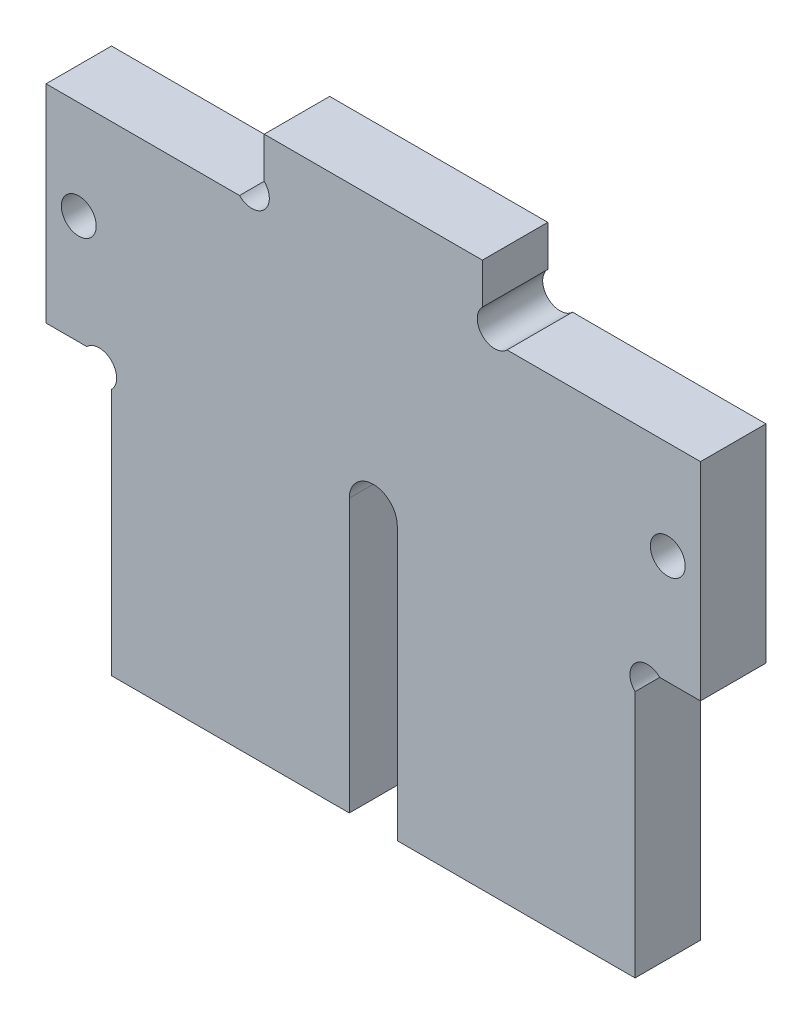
ISO-10303-21;
HEADER;
FILE_DESCRIPTION(('STEP AP214'),'2;1');
FILE_NAME('part.step','',(''),(''),'','','');
FILE_SCHEMA(('AUTOMOTIVE_DESIGN { 1 0 10303 214 1 1 1 1 }'));
ENDSEC;
DATA;
#1=APPLICATION_CONTEXT('core data for automotive mechanical design processes');
#2=APPLICATION_PROTOCOL_DEFINITION('international standard','automotive_design',2000,#1);
#3=PRODUCT_CONTEXT('',#1,'mechanical');
#4=PRODUCT('Part','Part','',(#3));
#5=PRODUCT_RELATED_PRODUCT_CATEGORY('part','',(#4));
#6=PRODUCT_DEFINITION_FORMATION('','',#4);
#7=PRODUCT_DEFINITION_CONTEXT('part definition',#1,'design');
#8=PRODUCT_DEFINITION('design','',#6,#7);
#9=PRODUCT_DEFINITION_SHAPE('','',#8);
#10=(LENGTH_UNIT() NAMED_UNIT(*) SI_UNIT(.MILLI.,.METRE.));
#11=(NAMED_UNIT(*) PLANE_ANGLE_UNIT() SI_UNIT($,.RADIAN.));
#12=(NAMED_UNIT(*) SI_UNIT($,.STERADIAN.) SOLID_ANGLE_UNIT());
#13=UNCERTAINTY_MEASURE_WITH_UNIT(LENGTH_MEASURE(1.E-05),#10,'distance_accuracy_value','');
#14=(GEOMETRIC_REPRESENTATION_CONTEXT(3) GLOBAL_UNCERTAINTY_ASSIGNED_CONTEXT((#13)) GLOBAL_UNIT_ASSIGNED_CONTEXT((#10,
#11,#12)) REPRESENTATION_CONTEXT('',''));
#15=CARTESIAN_POINT('',(0.,0.,0.));
#16=DIRECTION('',(0.,0.,1.));
#17=DIRECTION('',(1.,0.,0.));
#18=AXIS2_PLACEMENT_3D('',#15,#16,#17);
#19=CARTESIAN_POINT('',(11.1313708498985,45.1313708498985,6.));
#20=DIRECTION('',(0.,0.,1.));
#21=DIRECTION('',(1.,0.,0.));
#22=AXIS2_PLACEMENT_3D('',#19,#20,#21);
#23=PLANE('',#22);
#24=CARTESIAN_POINT('',(27.,35.,6.));
#25=DIRECTION('',(0.,0.,1.));
#26=DIRECTION('',(1.,0.,0.));
#27=AXIS2_PLACEMENT_3D('',#24,#25,#26);
#28=CIRCLE('',#27,1.6);
#29=CARTESIAN_POINT('',(28.6,35.,6.));
#30=VERTEX_POINT('',#29);
#31=EDGE_CURVE('E210',#30,#30,#28,.T.);
#32=ORIENTED_EDGE('',*,*,#31,.F.);
#33=EDGE_LOOP('',(#32));
#34=FACE_BOUND('',#33,.T.);
#35=CARTESIAN_POINT('',(11.1313708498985,45.1313708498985,6.));
#36=DIRECTION('',(0.,0.,-1.));
#37=DIRECTION('',(1.,0.,0.));
#38=AXIS2_PLACEMENT_3D('',#35,#36,#37);
#39=CIRCLE('',#38,1.60000000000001);
#40=CARTESIAN_POINT('',(12.262741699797,44.,6.));
#41=VERTEX_POINT('',#40);
#42=CARTESIAN_POINT('',(10.,46.262741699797,6.));
#43=VERTEX_POINT('',#42);
#44=EDGE_CURVE('E245',#41,#43,#39,.T.);
#45=ORIENTED_EDGE('',*,*,#44,.T.);
#46=DIRECTION('',(0.,1.,0.));
#47=VECTOR('',#46,1.);
#48=CARTESIAN_POINT('',(10.,46.262741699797,6.));
#49=LINE('',#48,#47);
#50=CARTESIAN_POINT('',(10.,50.,6.));
#51=VERTEX_POINT('',#50);
#52=EDGE_CURVE('E133',#43,#51,#49,.T.);
#53=ORIENTED_EDGE('',*,*,#52,.T.);
#54=DIRECTION('',(-1.,0.,0.));
#55=VECTOR('',#54,1.);
#56=CARTESIAN_POINT('',(-10.,50.,6.));
#57=LINE('',#56,#55);
#58=CARTESIAN_POINT('',(-10.,50.,6.));
#59=VERTEX_POINT('',#58);
#60=EDGE_CURVE('E296',#51,#59,#57,.T.);
#61=ORIENTED_EDGE('',*,*,#60,.T.);
#62=DIRECTION('',(0.,-1.,0.));
#63=VECTOR('',#62,1.);
#64=CARTESIAN_POINT('',(-10.,46.262741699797,6.));
#65=LINE('',#64,#63);
#66=CARTESIAN_POINT('',(-10.,46.262741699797,6.));
#67=VERTEX_POINT('',#66);
#68=EDGE_CURVE('E315',#59,#67,#65,.T.);
#69=ORIENTED_EDGE('',*,*,#68,.T.);
#70=CARTESIAN_POINT('',(-11.1313708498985,45.1313708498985,6.));
#71=DIRECTION('',(0.,0.,-1.));
#72=DIRECTION('',(-1.,0.,0.));
#73=AXIS2_PLACEMENT_3D('',#70,#71,#72);
#74=CIRCLE('',#73,1.60000000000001);
#75=CARTESIAN_POINT('',(-12.262741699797,44.,6.));
#76=VERTEX_POINT('',#75);
#77=EDGE_CURVE('E312',#67,#76,#74,.T.);
#78=ORIENTED_EDGE('',*,*,#77,.T.);
#79=DIRECTION('',(-1.,0.,0.));
#80=VECTOR('',#79,1.);
#81=CARTESIAN_POINT('',(-12.262741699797,44.,6.));
#82=LINE('',#81,#80);
#83=CARTESIAN_POINT('',(-30.,44.,6.));
#84=VERTEX_POINT('',#83);
#85=EDGE_CURVE('E314',#76,#84,#82,.T.);
#86=ORIENTED_EDGE('',*,*,#85,.T.);
#87=DIRECTION('',(0.,-1.,0.));
#88=VECTOR('',#87,1.);
#89=CARTESIAN_POINT('',(-30.,44.,6.));
#90=LINE('',#89,#88);
#91=CARTESIAN_POINT('',(-30.,25.,6.));
#92=VERTEX_POINT('',#91);
#93=EDGE_CURVE('E317',#84,#92,#90,.T.);
#94=ORIENTED_EDGE('',*,*,#93,.T.);
#95=DIRECTION('',(1.,0.,0.));
#96=VECTOR('',#95,1.);
#97=CARTESIAN_POINT('',(-30.,25.,6.));
#98=LINE('',#97,#96);
#99=CARTESIAN_POINT('',(-26.262741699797,25.,6.));
#100=VERTEX_POINT('',#99);
#101=EDGE_CURVE('E323',#92,#100,#98,.T.);
#102=ORIENTED_EDGE('',*,*,#101,.T.);
#103=CARTESIAN_POINT('',(-25.1313708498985,23.8686291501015,6.));
#104=DIRECTION('',(0.,0.,-1.));
#105=DIRECTION('',(-1.,0.,0.));
#106=AXIS2_PLACEMENT_3D('',#103,#104,#105);
#107=CIRCLE('',#106,1.60000000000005);
#108=CARTESIAN_POINT('',(-24.,22.737258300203,6.));
#109=VERTEX_POINT('',#108);
#110=EDGE_CURVE('E325',#100,#109,#107,.T.);
#111=ORIENTED_EDGE('',*,*,#110,.T.);
#112=DIRECTION('',(0.,-1.,0.));
#113=VECTOR('',#112,1.);
#114=CARTESIAN_POINT('',(-24.,22.737258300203,6.));
#115=LINE('',#114,#113);
#116=CARTESIAN_POINT('',(-24.,0.,6.));
#117=VERTEX_POINT('',#116);
#118=EDGE_CURVE('E327',#109,#117,#115,.T.);
#119=ORIENTED_EDGE('',*,*,#118,.T.);
#120=DIRECTION('',(1.,0.,0.));
#121=VECTOR('',#120,1.);
#122=CARTESIAN_POINT('',(-24.,0.,6.));
#123=LINE('',#122,#121);
#124=CARTESIAN_POINT('',(-2.2,0.,6.));
#125=VERTEX_POINT('',#124);
#126=EDGE_CURVE('E329',#117,#125,#123,.T.);
#127=ORIENTED_EDGE('',*,*,#126,.T.);
#128=DIRECTION('',(0.,1.,0.));
#129=VECTOR('',#128,1.);
#130=CARTESIAN_POINT('',(-2.2,25.,6.));
#131=LINE('',#130,#129);
#132=CARTESIAN_POINT('',(-2.2,25.,6.));
#133=VERTEX_POINT('',#132);
#134=EDGE_CURVE('E331',#125,#133,#131,.T.);
#135=ORIENTED_EDGE('',*,*,#134,.T.);
#136=CARTESIAN_POINT('',(0.,25.,6.));
#137=DIRECTION('',(0.,0.,-1.));
#138=DIRECTION('',(1.,0.,0.));
#139=AXIS2_PLACEMENT_3D('',#136,#137,#138);
#140=CIRCLE('',#139,2.2);
#141=CARTESIAN_POINT('',(2.2,25.,6.));
#142=VERTEX_POINT('',#141);
#143=EDGE_CURVE('E333',#133,#142,#140,.T.);
#144=ORIENTED_EDGE('',*,*,#143,.T.);
#145=DIRECTION('',(0.,-1.,0.));
#146=VECTOR('',#145,1.);
#147=CARTESIAN_POINT('',(2.2,25.,6.));
#148=LINE('',#147,#146);
#149=CARTESIAN_POINT('',(2.2,0.,6.));
#150=VERTEX_POINT('',#149);
#151=EDGE_CURVE('E335',#142,#150,#148,.T.);
#152=ORIENTED_EDGE('',*,*,#151,.T.);
#153=DIRECTION('',(1.,0.,0.));
#154=VECTOR('',#153,1.);
#155=CARTESIAN_POINT('',(2.2,0.,6.));
#156=LINE('',#155,#154);
#157=CARTESIAN_POINT('',(24.,0.,6.));
#158=VERTEX_POINT('',#157);
#159=EDGE_CURVE('E337',#150,#158,#156,.T.);
#160=ORIENTED_EDGE('',*,*,#159,.T.);
#161=DIRECTION('',(0.,1.,0.));
#162=VECTOR('',#161,1.);
#163=CARTESIAN_POINT('',(24.,22.7372583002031,6.));
#164=LINE('',#163,#162);
#165=CARTESIAN_POINT('',(24.,22.7372583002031,6.));
#166=VERTEX_POINT('',#165);
#167=EDGE_CURVE('E339',#158,#166,#164,.T.);
#168=ORIENTED_EDGE('',*,*,#167,.T.);
#169=CARTESIAN_POINT('',(25.1313708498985,23.8686291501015,6.));
#170=DIRECTION('',(0.,0.,-1.));
#171=DIRECTION('',(1.,0.,0.));
#172=AXIS2_PLACEMENT_3D('',#169,#170,#171);
#173=CIRCLE('',#172,1.60000000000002);
#174=CARTESIAN_POINT('',(26.262741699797,25.,6.));
#175=VERTEX_POINT('',#174);
#176=EDGE_CURVE('E188',#166,#175,#173,.T.);
#177=ORIENTED_EDGE('',*,*,#176,.T.);
#178=DIRECTION('',(1.,0.,0.));
#179=VECTOR('',#178,1.);
#180=CARTESIAN_POINT('',(30.,25.,6.));
#181=LINE('',#180,#179);
#182=CARTESIAN_POINT('',(30.,25.,6.));
#183=VERTEX_POINT('',#182);
#184=EDGE_CURVE('E182',#175,#183,#181,.T.);
#185=ORIENTED_EDGE('',*,*,#184,.T.);
#186=DIRECTION('',(0.,1.,0.));
#187=VECTOR('',#186,1.);
#188=CARTESIAN_POINT('',(30.,44.,6.));
#189=LINE('',#188,#187);
#190=CARTESIAN_POINT('',(30.,44.,6.));
#191=VERTEX_POINT('',#190);
#192=EDGE_CURVE('E186',#183,#191,#189,.T.);
#193=ORIENTED_EDGE('',*,*,#192,.T.);
#194=DIRECTION('',(-1.,0.,0.));
#195=VECTOR('',#194,1.);
#196=CARTESIAN_POINT('',(12.262741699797,44.,6.));
#197=LINE('',#196,#195);
#198=EDGE_CURVE('E54',#191,#41,#197,.T.);
#199=ORIENTED_EDGE('',*,*,#198,.T.);
#200=EDGE_LOOP('',(#45,#53,#61,#69,#78,#86,#94,#102,#111,#119,#127,#135,#144,#152,#160,#168,
#177,#185,#193,#199));
#201=FACE_BOUND('',#200,.T.);
#202=CARTESIAN_POINT('',(-27.,35.,6.));
#203=DIRECTION('',(0.,0.,1.));
#204=DIRECTION('',(-1.,0.,0.));
#205=AXIS2_PLACEMENT_3D('',#202,#203,#204);
#206=CIRCLE('',#205,1.6);
#207=CARTESIAN_POINT('',(-28.6,35.,6.));
#208=VERTEX_POINT('',#207);
#209=EDGE_CURVE('E382',#208,#208,#206,.T.);
#210=ORIENTED_EDGE('',*,*,#209,.F.);
#211=EDGE_LOOP('',(#210));
#212=FACE_BOUND('',#211,.T.);
#213=ADVANCED_FACE('F37',(#34,#201,#212),#23,.T.);
#214=CARTESIAN_POINT('',(11.1313708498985,45.1313708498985,0.));
#215=DIRECTION('',(0.,0.,1.));
#216=DIRECTION('',(1.,0.,0.));
#217=AXIS2_PLACEMENT_3D('',#214,#215,#216);
#218=PLANE('',#217);
#219=CARTESIAN_POINT('',(27.,35.,0.));
#220=DIRECTION('',(0.,0.,1.));
#221=DIRECTION('',(1.,0.,0.));
#222=AXIS2_PLACEMENT_3D('',#219,#220,#221);
#223=CIRCLE('',#222,1.6);
#224=CARTESIAN_POINT('',(28.6,35.,0.));
#225=VERTEX_POINT('',#224);
#226=EDGE_CURVE('E387',#225,#225,#223,.T.);
#227=ORIENTED_EDGE('',*,*,#226,.T.);
#228=EDGE_LOOP('',(#227));
#229=FACE_BOUND('',#228,.T.);
#230=CARTESIAN_POINT('',(11.1313708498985,45.1313708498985,0.));
#231=DIRECTION('',(0.,0.,-1.));
#232=DIRECTION('',(1.,0.,0.));
#233=AXIS2_PLACEMENT_3D('',#230,#231,#232);
#234=CIRCLE('',#233,1.60000000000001);
#235=CARTESIAN_POINT('',(12.262741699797,44.,0.));
#236=VERTEX_POINT('',#235);
#237=CARTESIAN_POINT('',(10.,46.262741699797,0.));
#238=VERTEX_POINT('',#237);
#239=EDGE_CURVE('E206',#236,#238,#234,.T.);
#240=ORIENTED_EDGE('',*,*,#239,.F.);
#241=DIRECTION('',(-1.,0.,0.));
#242=VECTOR('',#241,1.);
#243=CARTESIAN_POINT('',(12.262741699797,44.,0.));
#244=LINE('',#243,#242);
#245=CARTESIAN_POINT('',(30.,44.,0.));
#246=VERTEX_POINT('',#245);
#247=EDGE_CURVE('E125',#246,#236,#244,.T.);
#248=ORIENTED_EDGE('',*,*,#247,.F.);
#249=DIRECTION('',(0.,1.,0.));
#250=VECTOR('',#249,1.);
#251=CARTESIAN_POINT('',(30.,44.,0.));
#252=LINE('',#251,#250);
#253=CARTESIAN_POINT('',(30.,25.,0.));
#254=VERTEX_POINT('',#253);
#255=EDGE_CURVE('E119',#254,#246,#252,.T.);
#256=ORIENTED_EDGE('',*,*,#255,.F.);
#257=DIRECTION('',(1.,0.,0.));
#258=VECTOR('',#257,1.);
#259=CARTESIAN_POINT('',(30.,25.,0.));
#260=LINE('',#259,#258);
#261=CARTESIAN_POINT('',(26.262741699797,25.,0.));
#262=VERTEX_POINT('',#261);
#263=EDGE_CURVE('E196',#262,#254,#260,.T.);
#264=ORIENTED_EDGE('',*,*,#263,.F.);
#265=CARTESIAN_POINT('',(25.1313708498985,23.8686291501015,0.));
#266=DIRECTION('',(0.,0.,-1.));
#267=DIRECTION('',(1.,0.,0.));
#268=AXIS2_PLACEMENT_3D('',#265,#266,#267);
#269=CIRCLE('',#268,1.60000000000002);
#270=CARTESIAN_POINT('',(24.,22.7372583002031,0.));
#271=VERTEX_POINT('',#270);
#272=EDGE_CURVE('E240',#271,#262,#269,.T.);
#273=ORIENTED_EDGE('',*,*,#272,.F.);
#274=DIRECTION('',(0.,1.,0.));
#275=VECTOR('',#274,1.);
#276=CARTESIAN_POINT('',(24.,22.7372583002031,0.));
#277=LINE('',#276,#275);
#278=CARTESIAN_POINT('',(24.,0.,0.));
#279=VERTEX_POINT('',#278);
#280=EDGE_CURVE('E238',#279,#271,#277,.T.);
#281=ORIENTED_EDGE('',*,*,#280,.F.);
#282=DIRECTION('',(1.,0.,0.));
#283=VECTOR('',#282,1.);
#284=CARTESIAN_POINT('',(2.2,0.,0.));
#285=LINE('',#284,#283);
#286=CARTESIAN_POINT('',(2.2,0.,0.));
#287=VERTEX_POINT('',#286);
#288=EDGE_CURVE('E236',#287,#279,#285,.T.);
#289=ORIENTED_EDGE('',*,*,#288,.F.);
#290=DIRECTION('',(0.,-1.,0.));
#291=VECTOR('',#290,1.);
#292=CARTESIAN_POINT('',(2.2,25.,0.));
#293=LINE('',#292,#291);
#294=CARTESIAN_POINT('',(2.2,25.,0.));
#295=VERTEX_POINT('',#294);
#296=EDGE_CURVE('E234',#295,#287,#293,.T.);
#297=ORIENTED_EDGE('',*,*,#296,.F.);
#298=CARTESIAN_POINT('',(0.,25.,0.));
#299=DIRECTION('',(0.,0.,-1.));
#300=DIRECTION('',(1.,0.,0.));
#301=AXIS2_PLACEMENT_3D('',#298,#299,#300);
#302=CIRCLE('',#301,2.2);
#303=CARTESIAN_POINT('',(-2.2,25.,0.));
#304=VERTEX_POINT('',#303);
#305=EDGE_CURVE('E232',#304,#295,#302,.T.);
#306=ORIENTED_EDGE('',*,*,#305,.F.);
#307=DIRECTION('',(0.,1.,0.));
#308=VECTOR('',#307,1.);
#309=CARTESIAN_POINT('',(-2.2,25.,0.));
#310=LINE('',#309,#308);
#311=CARTESIAN_POINT('',(-2.2,0.,0.));
#312=VERTEX_POINT('',#311);
#313=EDGE_CURVE('E230',#312,#304,#310,.T.);
#314=ORIENTED_EDGE('',*,*,#313,.F.);
#315=DIRECTION('',(1.,0.,0.));
#316=VECTOR('',#315,1.);
#317=CARTESIAN_POINT('',(-24.,0.,0.));
#318=LINE('',#317,#316);
#319=CARTESIAN_POINT('',(-24.,0.,0.));
#320=VERTEX_POINT('',#319);
#321=EDGE_CURVE('E228',#320,#312,#318,.T.);
#322=ORIENTED_EDGE('',*,*,#321,.F.);
#323=DIRECTION('',(0.,-1.,0.));
#324=VECTOR('',#323,1.);
#325=CARTESIAN_POINT('',(-24.,22.737258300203,0.));
#326=LINE('',#325,#324);
#327=CARTESIAN_POINT('',(-24.,22.737258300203,0.));
#328=VERTEX_POINT('',#327);
#329=EDGE_CURVE('E226',#328,#320,#326,.T.);
#330=ORIENTED_EDGE('',*,*,#329,.F.);
#331=CARTESIAN_POINT('',(-25.1313708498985,23.8686291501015,0.));
#332=DIRECTION('',(0.,0.,-1.));
#333=DIRECTION('',(-1.,0.,0.));
#334=AXIS2_PLACEMENT_3D('',#331,#332,#333);
#335=CIRCLE('',#334,1.60000000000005);
#336=CARTESIAN_POINT('',(-26.262741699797,25.,0.));
#337=VERTEX_POINT('',#336);
#338=EDGE_CURVE('E224',#337,#328,#335,.T.);
#339=ORIENTED_EDGE('',*,*,#338,.F.);
#340=DIRECTION('',(1.,0.,0.));
#341=VECTOR('',#340,1.);
#342=CARTESIAN_POINT('',(-30.,25.,0.));
#343=LINE('',#342,#341);
#344=CARTESIAN_POINT('',(-30.,25.,0.));
#345=VERTEX_POINT('',#344);
#346=EDGE_CURVE('E222',#345,#337,#343,.T.);
#347=ORIENTED_EDGE('',*,*,#346,.F.);
#348=DIRECTION('',(0.,-1.,0.));
#349=VECTOR('',#348,1.);
#350=CARTESIAN_POINT('',(-30.,44.,0.));
#351=LINE('',#350,#349);
#352=CARTESIAN_POINT('',(-30.,44.,0.));
#353=VERTEX_POINT('',#352);
#354=EDGE_CURVE('E220',#353,#345,#351,.T.);
#355=ORIENTED_EDGE('',*,*,#354,.F.);
#356=DIRECTION('',(-1.,0.,0.));
#357=VECTOR('',#356,1.);
#358=CARTESIAN_POINT('',(-12.262741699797,44.,0.));
#359=LINE('',#358,#357);
#360=CARTESIAN_POINT('',(-12.262741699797,44.,0.));
#361=VERTEX_POINT('',#360);
#362=EDGE_CURVE('E218',#361,#353,#359,.T.);
#363=ORIENTED_EDGE('',*,*,#362,.F.);
#364=CARTESIAN_POINT('',(-11.1313708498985,45.1313708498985,0.));
#365=DIRECTION('',(0.,0.,-1.));
#366=DIRECTION('',(-1.,0.,0.));
#367=AXIS2_PLACEMENT_3D('',#364,#365,#366);
#368=CIRCLE('',#367,1.60000000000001);
#369=CARTESIAN_POINT('',(-10.,46.262741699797,0.));
#370=VERTEX_POINT('',#369);
#371=EDGE_CURVE('E216',#370,#361,#368,.T.);
#372=ORIENTED_EDGE('',*,*,#371,.F.);
#373=DIRECTION('',(0.,-1.,0.));
#374=VECTOR('',#373,1.);
#375=CARTESIAN_POINT('',(-10.,46.262741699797,0.));
#376=LINE('',#375,#374);
#377=CARTESIAN_POINT('',(-10.,50.,0.));
#378=VERTEX_POINT('',#377);
#379=EDGE_CURVE('E214',#378,#370,#376,.T.);
#380=ORIENTED_EDGE('',*,*,#379,.F.);
#381=DIRECTION('',(-1.,0.,0.));
#382=VECTOR('',#381,1.);
#383=CARTESIAN_POINT('',(-10.,50.,0.));
#384=LINE('',#383,#382);
#385=CARTESIAN_POINT('',(10.,50.,0.));
#386=VERTEX_POINT('',#385);
#387=EDGE_CURVE('E212',#386,#378,#384,.T.);
#388=ORIENTED_EDGE('',*,*,#387,.F.);
#389=DIRECTION('',(0.,1.,0.));
#390=VECTOR('',#389,1.);
#391=CARTESIAN_POINT('',(10.,46.262741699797,0.));
#392=LINE('',#391,#390);
#393=EDGE_CURVE('E209',#238,#386,#392,.T.);
#394=ORIENTED_EDGE('',*,*,#393,.F.);
#395=EDGE_LOOP('',(#240,#248,#256,#264,#273,#281,#289,#297,#306,#314,#322,#330,#339,#347,#355,
#363,#372,#380,#388,#394));
#396=FACE_BOUND('',#395,.T.);
#397=CARTESIAN_POINT('',(-27.,35.,0.));
#398=DIRECTION('',(0.,0.,1.));
#399=DIRECTION('',(-1.,0.,0.));
#400=AXIS2_PLACEMENT_3D('',#397,#398,#399);
#401=CIRCLE('',#400,1.6);
#402=CARTESIAN_POINT('',(-28.6,35.,0.));
#403=VERTEX_POINT('',#402);
#404=EDGE_CURVE('E385',#403,#403,#401,.T.);
#405=ORIENTED_EDGE('',*,*,#404,.T.);
#406=EDGE_LOOP('',(#405));
#407=FACE_BOUND('',#406,.T.);
#408=ADVANCED_FACE('F300',(#229,#396,#407),#218,.F.);
#409=CARTESIAN_POINT('',(11.1313708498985,45.1313708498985,6.));
#410=DIRECTION('',(0.,0.,-1.));
#411=DIRECTION('',(-1.,0.,0.));
#412=AXIS2_PLACEMENT_3D('',#409,#410,#411);
#413=CYLINDRICAL_SURFACE('',#412,1.60000000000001);
#414=ORIENTED_EDGE('',*,*,#239,.T.);
#415=DIRECTION('',(0.,0.,-1.));
#416=VECTOR('',#415,1.);
#417=CARTESIAN_POINT('',(10.,46.262741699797,6.));
#418=LINE('',#417,#416);
#419=EDGE_CURVE('E11',#43,#238,#418,.T.);
#420=ORIENTED_EDGE('',*,*,#419,.F.);
#421=ORIENTED_EDGE('',*,*,#44,.F.);
#422=DIRECTION('',(0.,0.,-1.));
#423=VECTOR('',#422,1.);
#424=CARTESIAN_POINT('',(12.262741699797,44.,6.));
#425=LINE('',#424,#423);
#426=EDGE_CURVE('E202',#41,#236,#425,.T.);
#427=ORIENTED_EDGE('',*,*,#426,.T.);
#428=EDGE_LOOP('',(#414,#420,#421,#427));
#429=FACE_BOUND('',#428,.T.);
#430=ADVANCED_FACE('F39',(#429),#413,.F.);
#431=CARTESIAN_POINT('',(10.,46.262741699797,6.));
#432=DIRECTION('',(-1.,0.,0.));
#433=DIRECTION('',(0.,0.,1.));
#434=AXIS2_PLACEMENT_3D('',#431,#432,#433);
#435=PLANE('',#434);
#436=ORIENTED_EDGE('',*,*,#393,.T.);
#437=DIRECTION('',(0.,0.,-1.));
#438=VECTOR('',#437,1.);
#439=CARTESIAN_POINT('',(10.,50.,6.));
#440=LINE('',#439,#438);
#441=EDGE_CURVE('E46',#51,#386,#440,.T.);
#442=ORIENTED_EDGE('',*,*,#441,.F.);
#443=ORIENTED_EDGE('',*,*,#52,.F.);
#444=ORIENTED_EDGE('',*,*,#419,.T.);
#445=EDGE_LOOP('',(#436,#442,#443,#444));
#446=FACE_BOUND('',#445,.T.);
#447=ADVANCED_FACE('F560',(#446),#435,.F.);
#448=CARTESIAN_POINT('',(-10.,50.,6.));
#449=DIRECTION('',(0.,-1.,0.));
#450=DIRECTION('',(0.,0.,-1.));
#451=AXIS2_PLACEMENT_3D('',#448,#449,#450);
#452=PLANE('',#451);
#453=ORIENTED_EDGE('',*,*,#387,.T.);
#454=DIRECTION('',(0.,0.,-1.));
#455=VECTOR('',#454,1.);
#456=CARTESIAN_POINT('',(-10.,50.,6.));
#457=LINE('',#456,#455);
#458=EDGE_CURVE('E288',#59,#378,#457,.T.);
#459=ORIENTED_EDGE('',*,*,#458,.F.);
#460=ORIENTED_EDGE('',*,*,#60,.F.);
#461=ORIENTED_EDGE('',*,*,#441,.T.);
#462=EDGE_LOOP('',(#453,#459,#460,#461));
#463=FACE_BOUND('',#462,.T.);
#464=ADVANCED_FACE('F294',(#463),#452,.F.);
#465=CARTESIAN_POINT('',(-10.,46.262741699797,6.));
#466=DIRECTION('',(1.,0.,0.));
#467=DIRECTION('',(0.,1.,0.));
#468=AXIS2_PLACEMENT_3D('',#465,#466,#467);
#469=PLANE('',#468);
#470=ORIENTED_EDGE('',*,*,#379,.T.);
#471=DIRECTION('',(0.,0.,-1.));
#472=VECTOR('',#471,1.);
#473=CARTESIAN_POINT('',(-10.,46.262741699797,6.));
#474=LINE('',#473,#472);
#475=EDGE_CURVE('E285',#67,#370,#474,.T.);
#476=ORIENTED_EDGE('',*,*,#475,.F.);
#477=ORIENTED_EDGE('',*,*,#68,.F.);
#478=ORIENTED_EDGE('',*,*,#458,.T.);
#479=EDGE_LOOP('',(#470,#476,#477,#478));
#480=FACE_BOUND('',#479,.T.);
#481=ADVANCED_FACE('F306',(#480),#469,.F.);
#482=CARTESIAN_POINT('',(-11.1313708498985,45.1313708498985,6.));
#483=DIRECTION('',(0.,0.,-1.));
#484=DIRECTION('',(-1.,0.,0.));
#485=AXIS2_PLACEMENT_3D('',#482,#483,#484);
#486=CYLINDRICAL_SURFACE('',#485,1.60000000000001);
#487=ORIENTED_EDGE('',*,*,#371,.T.);
#488=DIRECTION('',(0.,0.,-1.));
#489=VECTOR('',#488,1.);
#490=CARTESIAN_POINT('',(-12.262741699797,44.,6.));
#491=LINE('',#490,#489);
#492=EDGE_CURVE('E282',#76,#361,#491,.T.);
#493=ORIENTED_EDGE('',*,*,#492,.F.);
#494=ORIENTED_EDGE('',*,*,#77,.F.);
#495=ORIENTED_EDGE('',*,*,#475,.T.);
#496=EDGE_LOOP('',(#487,#493,#494,#495));
#497=FACE_BOUND('',#496,.T.);
#498=ADVANCED_FACE('F310',(#497),#486,.F.);
#499=CARTESIAN_POINT('',(-12.262741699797,44.,6.));
#500=DIRECTION('',(0.,-1.,0.));
#501=DIRECTION('',(0.,0.,-1.));
#502=AXIS2_PLACEMENT_3D('',#499,#500,#501);
#503=PLANE('',#502);
#504=ORIENTED_EDGE('',*,*,#362,.T.);
#505=DIRECTION('',(0.,0.,-1.));
#506=VECTOR('',#505,1.);
#507=CARTESIAN_POINT('',(-30.,44.,6.));
#508=LINE('',#507,#506);
#509=EDGE_CURVE('E279',#84,#353,#508,.T.);
#510=ORIENTED_EDGE('',*,*,#509,.F.);
#511=ORIENTED_EDGE('',*,*,#85,.F.);
#512=ORIENTED_EDGE('',*,*,#492,.T.);
#513=EDGE_LOOP('',(#504,#510,#511,#512));
#514=FACE_BOUND('',#513,.T.);
#515=ADVANCED_FACE('F525',(#514),#503,.F.);
#516=CARTESIAN_POINT('',(-30.,44.,6.));
#517=DIRECTION('',(1.,0.,0.));
#518=DIRECTION('',(0.,0.,-1.));
#519=AXIS2_PLACEMENT_3D('',#516,#517,#518);
#520=PLANE('',#519);
#521=ORIENTED_EDGE('',*,*,#354,.T.);
#522=DIRECTION('',(0.,0.,-1.));
#523=VECTOR('',#522,1.);
#524=CARTESIAN_POINT('',(-30.,25.,6.));
#525=LINE('',#524,#523);
#526=EDGE_CURVE('E276',#92,#345,#525,.T.);
#527=ORIENTED_EDGE('',*,*,#526,.F.);
#528=ORIENTED_EDGE('',*,*,#93,.F.);
#529=ORIENTED_EDGE('',*,*,#509,.T.);
#530=EDGE_LOOP('',(#521,#527,#528,#529));
#531=FACE_BOUND('',#530,.T.);
#532=ADVANCED_FACE('F515',(#531),#520,.F.);
#533=CARTESIAN_POINT('',(-30.,25.,6.));
#534=DIRECTION('',(0.,1.,0.));
#535=DIRECTION('',(-1.,0.,0.));
#536=AXIS2_PLACEMENT_3D('',#533,#534,#535);
#537=PLANE('',#536);
#538=ORIENTED_EDGE('',*,*,#346,.T.);
#539=DIRECTION('',(0.,0.,-1.));
#540=VECTOR('',#539,1.);
#541=CARTESIAN_POINT('',(-26.262741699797,25.,6.));
#542=LINE('',#541,#540);
#543=EDGE_CURVE('E273',#100,#337,#542,.T.);
#544=ORIENTED_EDGE('',*,*,#543,.F.);
#545=ORIENTED_EDGE('',*,*,#101,.F.);
#546=ORIENTED_EDGE('',*,*,#526,.T.);
#547=EDGE_LOOP('',(#538,#544,#545,#546));
#548=FACE_BOUND('',#547,.T.);
#549=ADVANCED_FACE('F505',(#548),#537,.F.);
#550=CARTESIAN_POINT('',(-25.1313708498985,23.8686291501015,6.));
#551=DIRECTION('',(0.,0.,-1.));
#552=DIRECTION('',(-1.,0.,0.));
#553=AXIS2_PLACEMENT_3D('',#550,#551,#552);
#554=CYLINDRICAL_SURFACE('',#553,1.60000000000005);
#555=ORIENTED_EDGE('',*,*,#338,.T.);
#556=DIRECTION('',(0.,0.,-1.));
#557=VECTOR('',#556,1.);
#558=CARTESIAN_POINT('',(-24.,22.737258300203,6.));
#559=LINE('',#558,#557);
#560=EDGE_CURVE('E270',#109,#328,#559,.T.);
#561=ORIENTED_EDGE('',*,*,#560,.F.);
#562=ORIENTED_EDGE('',*,*,#110,.F.);
#563=ORIENTED_EDGE('',*,*,#543,.T.);
#564=EDGE_LOOP('',(#555,#561,#562,#563));
#565=FACE_BOUND('',#564,.T.);
#566=ADVANCED_FACE('F495',(#565),#554,.F.);
#567=CARTESIAN_POINT('',(-24.,22.737258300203,6.));
#568=DIRECTION('',(1.,0.,0.));
#569=DIRECTION('',(0.,1.,0.));
#570=AXIS2_PLACEMENT_3D('',#567,#568,#569);
#571=PLANE('',#570);
#572=ORIENTED_EDGE('',*,*,#329,.T.);
#573=DIRECTION('',(0.,0.,-1.));
#574=VECTOR('',#573,1.);
#575=CARTESIAN_POINT('',(-24.,0.,6.));
#576=LINE('',#575,#574);
#577=EDGE_CURVE('E267',#117,#320,#576,.T.);
#578=ORIENTED_EDGE('',*,*,#577,.F.);
#579=ORIENTED_EDGE('',*,*,#118,.F.);
#580=ORIENTED_EDGE('',*,*,#560,.T.);
#581=EDGE_LOOP('',(#572,#578,#579,#580));
#582=FACE_BOUND('',#581,.T.);
#583=ADVANCED_FACE('F485',(#582),#571,.F.);
#584=CARTESIAN_POINT('',(-24.,0.,6.));
#585=DIRECTION('',(0.,1.,0.));
#586=DIRECTION('',(0.,0.,1.));
#587=AXIS2_PLACEMENT_3D('',#584,#585,#586);
#588=PLANE('',#587);
#589=ORIENTED_EDGE('',*,*,#321,.T.);
#590=DIRECTION('',(0.,0.,-1.));
#591=VECTOR('',#590,1.);
#592=CARTESIAN_POINT('',(-2.2,0.,6.));
#593=LINE('',#592,#591);
#594=EDGE_CURVE('E264',#125,#312,#593,.T.);
#595=ORIENTED_EDGE('',*,*,#594,.F.);
#596=ORIENTED_EDGE('',*,*,#126,.F.);
#597=ORIENTED_EDGE('',*,*,#577,.T.);
#598=EDGE_LOOP('',(#589,#595,#596,#597));
#599=FACE_BOUND('',#598,.T.);
#600=ADVANCED_FACE('F475',(#599),#588,.F.);
#601=CARTESIAN_POINT('',(-2.2,25.,6.));
#602=DIRECTION('',(-1.,0.,0.));
#603=DIRECTION('',(0.,-1.,0.));
#604=AXIS2_PLACEMENT_3D('',#601,#602,#603);
#605=PLANE('',#604);
#606=ORIENTED_EDGE('',*,*,#313,.T.);
#607=DIRECTION('',(0.,0.,-1.));
#608=VECTOR('',#607,1.);
#609=CARTESIAN_POINT('',(-2.2,25.,6.));
#610=LINE('',#609,#608);
#611=EDGE_CURVE('E261',#133,#304,#610,.T.);
#612=ORIENTED_EDGE('',*,*,#611,.F.);
#613=ORIENTED_EDGE('',*,*,#134,.F.);
#614=ORIENTED_EDGE('',*,*,#594,.T.);
#615=EDGE_LOOP('',(#606,#612,#613,#614));
#616=FACE_BOUND('',#615,.T.);
#617=ADVANCED_FACE('F465',(#616),#605,.F.);
#618=CARTESIAN_POINT('',(0.,25.,6.));
#619=DIRECTION('',(0.,0.,-1.));
#620=DIRECTION('',(-1.,0.,0.));
#621=AXIS2_PLACEMENT_3D('',#618,#619,#620);
#622=CYLINDRICAL_SURFACE('',#621,2.2);
#623=ORIENTED_EDGE('',*,*,#305,.T.);
#624=DIRECTION('',(0.,0.,-1.));
#625=VECTOR('',#624,1.);
#626=CARTESIAN_POINT('',(2.2,25.,6.));
#627=LINE('',#626,#625);
#628=EDGE_CURVE('E258',#142,#295,#627,.T.);
#629=ORIENTED_EDGE('',*,*,#628,.F.);
#630=ORIENTED_EDGE('',*,*,#143,.F.);
#631=ORIENTED_EDGE('',*,*,#611,.T.);
#632=EDGE_LOOP('',(#623,#629,#630,#631));
#633=FACE_BOUND('',#632,.T.);
#634=ADVANCED_FACE('F455',(#633),#622,.F.);
#635=CARTESIAN_POINT('',(2.2,25.,6.));
#636=DIRECTION('',(1.,0.,0.));
#637=DIRECTION('',(0.,0.,-1.));
#638=AXIS2_PLACEMENT_3D('',#635,#636,#637);
#639=PLANE('',#638);
#640=ORIENTED_EDGE('',*,*,#296,.T.);
#641=DIRECTION('',(0.,0.,-1.));
#642=VECTOR('',#641,1.);
#643=CARTESIAN_POINT('',(2.2,0.,6.));
#644=LINE('',#643,#642);
#645=EDGE_CURVE('E255',#150,#287,#644,.T.);
#646=ORIENTED_EDGE('',*,*,#645,.F.);
#647=ORIENTED_EDGE('',*,*,#151,.F.);
#648=ORIENTED_EDGE('',*,*,#628,.T.);
#649=EDGE_LOOP('',(#640,#646,#647,#648));
#650=FACE_BOUND('',#649,.T.);
#651=ADVANCED_FACE('F445',(#650),#639,.F.);
#652=CARTESIAN_POINT('',(2.2,0.,6.));
#653=DIRECTION('',(0.,1.,0.));
#654=DIRECTION('',(0.,0.,1.));
#655=AXIS2_PLACEMENT_3D('',#652,#653,#654);
#656=PLANE('',#655);
#657=ORIENTED_EDGE('',*,*,#288,.T.);
#658=DIRECTION('',(0.,0.,-1.));
#659=VECTOR('',#658,1.);
#660=CARTESIAN_POINT('',(24.,0.,6.));
#661=LINE('',#660,#659);
#662=EDGE_CURVE('E252',#158,#279,#661,.T.);
#663=ORIENTED_EDGE('',*,*,#662,.F.);
#664=ORIENTED_EDGE('',*,*,#159,.F.);
#665=ORIENTED_EDGE('',*,*,#645,.T.);
#666=EDGE_LOOP('',(#657,#663,#664,#665));
#667=FACE_BOUND('',#666,.T.);
#668=ADVANCED_FACE('F436',(#667),#656,.F.);
#669=CARTESIAN_POINT('',(24.,22.7372583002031,6.));
#670=DIRECTION('',(-1.,0.,0.));
#671=DIRECTION('',(0.,-1.,0.));
#672=AXIS2_PLACEMENT_3D('',#669,#670,#671);
#673=PLANE('',#672);
#674=ORIENTED_EDGE('',*,*,#280,.T.);
#675=DIRECTION('',(0.,0.,-1.));
#676=VECTOR('',#675,1.);
#677=CARTESIAN_POINT('',(24.,22.7372583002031,6.));
#678=LINE('',#677,#676);
#679=EDGE_CURVE('E249',#166,#271,#678,.T.);
#680=ORIENTED_EDGE('',*,*,#679,.F.);
#681=ORIENTED_EDGE('',*,*,#167,.F.);
#682=ORIENTED_EDGE('',*,*,#662,.T.);
#683=EDGE_LOOP('',(#674,#680,#681,#682));
#684=FACE_BOUND('',#683,.T.);
#685=ADVANCED_FACE('F345',(#684),#673,.F.);
#686=CARTESIAN_POINT('',(25.1313708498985,23.8686291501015,6.));
#687=DIRECTION('',(0.,0.,-1.));
#688=DIRECTION('',(-1.,0.,0.));
#689=AXIS2_PLACEMENT_3D('',#686,#687,#688);
#690=CYLINDRICAL_SURFACE('',#689,1.60000000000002);
#691=ORIENTED_EDGE('',*,*,#272,.T.);
#692=DIRECTION('',(0.,0.,-1.));
#693=VECTOR('',#692,1.);
#694=CARTESIAN_POINT('',(26.262741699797,25.,6.));
#695=LINE('',#694,#693);
#696=EDGE_CURVE('E197',#175,#262,#695,.T.);
#697=ORIENTED_EDGE('',*,*,#696,.F.);
#698=ORIENTED_EDGE('',*,*,#176,.F.);
#699=ORIENTED_EDGE('',*,*,#679,.T.);
#700=EDGE_LOOP('',(#691,#697,#698,#699));
#701=FACE_BOUND('',#700,.T.);
#702=ADVANCED_FACE('F349',(#701),#690,.F.);
#703=CARTESIAN_POINT('',(30.,25.,6.));
#704=DIRECTION('',(0.,1.,0.));
#705=DIRECTION('',(-1.,0.,0.));
#706=AXIS2_PLACEMENT_3D('',#703,#704,#705);
#707=PLANE('',#706);
#708=ORIENTED_EDGE('',*,*,#263,.T.);
#709=DIRECTION('',(0.,0.,-1.));
#710=VECTOR('',#709,1.);
#711=CARTESIAN_POINT('',(30.,25.,6.));
#712=LINE('',#711,#710);
#713=EDGE_CURVE('E193',#183,#254,#712,.T.);
#714=ORIENTED_EDGE('',*,*,#713,.F.);
#715=ORIENTED_EDGE('',*,*,#184,.F.);
#716=ORIENTED_EDGE('',*,*,#696,.T.);
#717=EDGE_LOOP('',(#708,#714,#715,#716));
#718=FACE_BOUND('',#717,.T.);
#719=ADVANCED_FACE('F194',(#718),#707,.F.);
#720=CARTESIAN_POINT('',(30.,44.,6.));
#721=DIRECTION('',(-1.,0.,0.));
#722=DIRECTION('',(0.,0.,1.));
#723=AXIS2_PLACEMENT_3D('',#720,#721,#722);
#724=PLANE('',#723);
#725=ORIENTED_EDGE('',*,*,#255,.T.);
#726=DIRECTION('',(0.,0.,-1.));
#727=VECTOR('',#726,1.);
#728=CARTESIAN_POINT('',(30.,44.,6.));
#729=LINE('',#728,#727);
#730=EDGE_CURVE('E198',#191,#246,#729,.T.);
#731=ORIENTED_EDGE('',*,*,#730,.F.);
#732=ORIENTED_EDGE('',*,*,#192,.F.);
#733=ORIENTED_EDGE('',*,*,#713,.T.);
#734=EDGE_LOOP('',(#725,#731,#732,#733));
#735=FACE_BOUND('',#734,.T.);
#736=ADVANCED_FACE('F200',(#735),#724,.F.);
#737=CARTESIAN_POINT('',(12.262741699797,44.,6.));
#738=DIRECTION('',(0.,-1.,0.));
#739=DIRECTION('',(0.,0.,-1.));
#740=AXIS2_PLACEMENT_3D('',#737,#738,#739);
#741=PLANE('',#740);
#742=ORIENTED_EDGE('',*,*,#247,.T.);
#743=ORIENTED_EDGE('',*,*,#426,.F.);
#744=ORIENTED_EDGE('',*,*,#198,.F.);
#745=ORIENTED_EDGE('',*,*,#730,.T.);
#746=EDGE_LOOP('',(#742,#743,#744,#745));
#747=FACE_BOUND('',#746,.T.);
#748=ADVANCED_FACE('F353',(#747),#741,.F.);
#749=CARTESIAN_POINT('',(27.,35.,6.));
#750=DIRECTION('',(0.,0.,-1.));
#751=DIRECTION('',(-1.,0.,0.));
#752=AXIS2_PLACEMENT_3D('',#749,#750,#751);
#753=CYLINDRICAL_SURFACE('',#752,1.6);
#754=ORIENTED_EDGE('',*,*,#31,.T.);
#755=EDGE_LOOP('',(#754));
#756=FACE_BOUND('',#755,.T.);
#757=ORIENTED_EDGE('',*,*,#226,.F.);
#758=EDGE_LOOP('',(#757));
#759=FACE_BOUND('',#758,.T.);
#760=ADVANCED_FACE('F355',(#756,#759),#753,.F.);
#761=CARTESIAN_POINT('',(-27.,35.,6.));
#762=DIRECTION('',(0.,0.,-1.));
#763=DIRECTION('',(-1.,0.,0.));
#764=AXIS2_PLACEMENT_3D('',#761,#762,#763);
#765=CYLINDRICAL_SURFACE('',#764,1.6);
#766=ORIENTED_EDGE('',*,*,#209,.T.);
#767=EDGE_LOOP('',(#766));
#768=FACE_BOUND('',#767,.T.);
#769=ORIENTED_EDGE('',*,*,#404,.F.);
#770=EDGE_LOOP('',(#769));
#771=FACE_BOUND('',#770,.T.);
#772=ADVANCED_FACE('F361',(#768,#771),#765,.F.);
#773=CLOSED_SHELL('',(#213,#408,#430,#447,#464,#481,#498,#515,#532,#549,#566,#583,#600,#617,
#634,#651,#668,#685,#702,#719,#736,#748,#760,#772));
#774=MANIFOLD_SOLID_BREP('B2',#773);
#775=ADVANCED_BREP_SHAPE_REPRESENTATION('',(#18,#774),#14);
#776=SHAPE_DEFINITION_REPRESENTATION(#9,#775);
ENDSEC;
END-ISO-10303-21;
